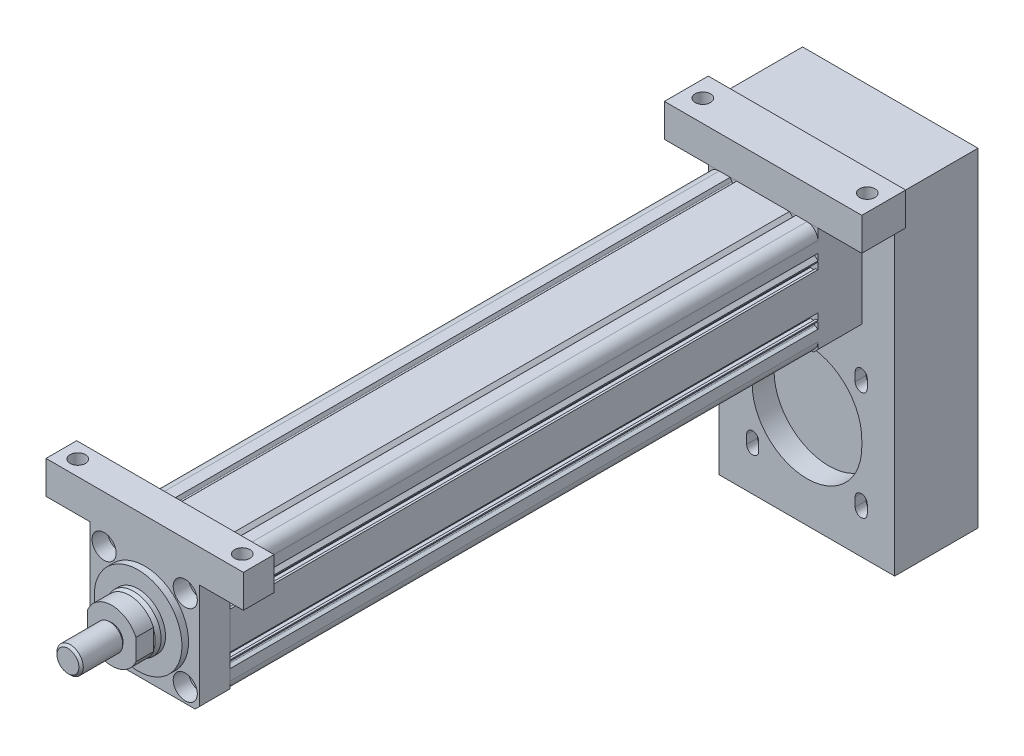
from build123d import *

# Parameters (mm, degrees)
SKETCH_1_R           = 20
SKETCH_1_R_2         = 2.75
EXTRUDE_1_DEPTH      = 268
FILLET_1_R           = 5
EXTRUDE_2_DEPTH      = 14
SKETCH_3_R           = 20
EXTRUDE_3_DEPTH      = 3
SKETCH_5_R           = 12.5
EXTRUDE_4_DEPTH      = 4
CHAMFER_1_SIZE       = 2
CHAMFER_1_SIZE2      = 0.7
EXTRUDE_5_DEPTH      = 8
SKETCH_7_R           = 5.15
EXTRUDE_6_DEPTH      = 1
SKETCH_8_R           = 6
EXTRUDE_7_DEPTH      = 19
CHAMFER_2_SIZE       = 1
SKETCH_23_W          = 50
SKETCH_23_H          = 50
EXTRUDE_8_DEPTH      = 20
SKETCH_4_R           = 3.5
CUT_EXTRUDE_5_DEPTH  = 30
SKETCH_4_6_R         = 5.5
CUT_EXTRUDE_6_DEPTH  = 7
SKETCH_35_W          = 80
SKETCH_35_H          = 150
EXTRUDE_10_DEPTH     = 38
CUT_EXTRUDE_11_DEPTH = 10
CUT_EXTRUDE_12_DEPTH = 10
CUT_EXTRUDE_START    = 10
CUT_EXTRUDE_13_DEPTH = 5
SKETCH_36_W          = 90
SKETCH_36_H          = 20
SKETCH_36_R          = 3.5
SKETCH_36_H_2        = 14
EXTRUDE_11_DEPTH     = 15
CHAMFER_4_SIZE       = 2
CHAMFER_5_SIZE       = 2


with BuildPart() as part:
    # Sketch 1 → Extrude 1 (new body)
    with BuildSketch(Plane.XY):
        with BuildLine():
            Line((-25, 25), (-15, 25))
            Line((-15, 25), (-14.227730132, 23.662389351))
            ThreePointArc((-14.227730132, 23.662389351), (-13.859980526, 23.416666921), (-13.441164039, 23.558835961))
            Line((-13.441164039, 23.558835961), (-12, 25))
            Line((-12, 25), (12, 25))
            Line((12, 25), (13.441164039, 23.558835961))
            ThreePointArc((13.441164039, 23.558835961), (13.859980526, 23.416666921), (14.227730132, 23.662389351))
            Line((14.227730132, 23.662389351), (15, 25))
            Line((15, 25), (25, 25))
            Line((25, 25), (25, 15))
            Line((25, 15), (23.662389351, 14.227730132))
            ThreePointArc((23.662389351, 14.227730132), (23.416666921, 13.859980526), (23.558835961, 13.441164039))
            Line((23.558835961, 13.441164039), (25, 12))
            Line((25, 12), (25, 11.5))
            Line((25, 11.5), (24, 11.5))
            Line((24, 11.5), (24, 12.4))
            Line((24, 12.4), (21.5, 12.4))
            Line((21.5, 12.4), (21.5, 7.6))
            Line((21.5, 7.6), (24, 7.6))
            Line((24, 7.6), (24, 8.5))
            Line((24, 8.5), (25, 8.5))
            Line((25, 8.5), (25, -8.5))
            Line((25, -8.5), (24, -8.5))
            Line((24, -8.5), (24, -7.6))
            Line((24, -7.6), (21.5, -7.6))
            Line((21.5, -7.6), (21.5, -12.4))
            Line((21.5, -12.4), (24, -12.4))
            Line((24, -12.4), (24, -11.5))
            Line((24, -11.5), (25, -11.5))
            Line((25, -11.5), (25, -12))
            Line((25, -12), (23.558835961, -13.441164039))
            ThreePointArc((23.558835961, -13.441164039), (23.416666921, -13.859980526), (23.662389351, -14.227730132))
            Line((23.662389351, -14.227730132), (25, -15))
            Line((25, -15), (25, -25))
            Line((25, -25), (15, -25))
            Line((15, -25), (14.227730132, -23.662389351))
            ThreePointArc((14.227730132, -23.662389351), (13.859980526, -23.416666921), (13.441164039, -23.558835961))
            Line((13.441164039, -23.558835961), (12, -25))
            Line((12, -25), (11.5, -25))
            Line((11.5, -25), (11.5, -24))
            Line((11.5, -24), (12.4, -24))
            Line((12.4, -24), (12.4, -21.5))
            Line((12.4, -21.5), (7.6, -21.5))
            Line((7.6, -21.5), (7.6, -24))
            Line((7.6, -24), (8.5, -24))
            Line((8.5, -24), (8.5, -25))
            Line((8.5, -25), (-8.5, -25))
            Line((-8.5, -25), (-8.5, -24))
            Line((-8.5, -24), (-7.6, -24))
            Line((-7.6, -24), (-7.6, -21.5))
            Line((-7.6, -21.5), (-12.4, -21.5))
            Line((-12.4, -21.5), (-12.4, -24))
            Line((-12.4, -24), (-11.5, -24))
            Line((-11.5, -24), (-11.5, -25))
            Line((-11.5, -25), (-12, -25))
            Line((-12, -25), (-13.441164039, -23.558835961))
            ThreePointArc((-13.441164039, -23.558835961), (-13.859980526, -23.416666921), (-14.227730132, -23.662389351))
            Line((-14.227730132, -23.662389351), (-15, -25))
            Line((-15, -25), (-25, -25))
            Line((-25, -25), (-25, -15))
            Line((-25, -15), (-23.662389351, -14.227730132))
            ThreePointArc((-23.662389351, -14.227730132), (-23.416666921, -13.859980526), (-23.558835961, -13.441164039))
            Line((-23.558835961, -13.441164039), (-25, -12))
            Line((-25, -12), (-25, -11.5))
            Line((-25, -11.5), (-24, -11.5))
            Line((-24, -11.5), (-24, -12.4))
            Line((-24, -12.4), (-21.5, -12.4))
            Line((-21.5, -12.4), (-21.5, -7.6))
            Line((-21.5, -7.6), (-24, -7.6))
            Line((-24, -7.6), (-24, -8.5))
            Line((-24, -8.5), (-25, -8.5))
            Line((-25, -8.5), (-25, 8.5))
            Line((-25, 8.5), (-24, 8.5))
            Line((-24, 8.5), (-24, 7.6))
            Line((-24, 7.6), (-21.5, 7.6))
            Line((-21.5, 7.6), (-21.5, 12.4))
            Line((-21.5, 12.4), (-24, 12.4))
            Line((-24, 12.4), (-24, 11.5))
            Line((-24, 11.5), (-25, 11.5))
            Line((-25, 11.5), (-25, 12))
            Line((-25, 12), (-23.558835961, 13.441164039))
            ThreePointArc((-23.558835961, 13.441164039), (-23.416666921, 13.859980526), (-23.662389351, 14.227730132))
            Line((-23.662389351, 14.227730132), (-25, 15))
            Line((-25, 15), (-25, 25))
        make_face()
        Circle(SKETCH_1_R, mode=Mode.SUBTRACT)
        with Locations((-18.5, 18.5)):
            Circle(SKETCH_1_R_2, mode=Mode.SUBTRACT)
        with Locations((18.5, 18.5)):
            Circle(SKETCH_1_R_2, mode=Mode.SUBTRACT)
        with Locations((18.5, -18.5)):
            Circle(SKETCH_1_R_2, mode=Mode.SUBTRACT)
        with Locations((-18.5, -18.5)):
            Circle(SKETCH_1_R_2, mode=Mode.SUBTRACT)
        with BuildLine():
            Line((-13.868836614, 23), (-5, 23))
            ThreePointArc((-5, 23), (-4.502985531, 22.554558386), (-4.891534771, 22.01190647))
            ThreePointArc((-4.891534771, 22.01190647), (-10.498377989, 19.955831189), (-15.368836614, 16.5))
            Line((-15.368836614, 16.5), (-15.368836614, 21.5))
            Line((-15.368836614, 21.5), (-13.868836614, 23))
        make_face(mode=Mode.SUBTRACT)
        with BuildLine():
            Line((15.368836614, 16.5), (15.368836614, 21.5))
            Line((15.368836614, 21.5), (13.868836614, 23))
            Line((13.868836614, 23), (5, 23))
            ThreePointArc((5, 23), (4.502985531, 22.554558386), (4.891534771, 22.01190647))
            ThreePointArc((4.891534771, 22.01190647), (10.498377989, 19.955831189), (15.368836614, 16.5))
        make_face(mode=Mode.SUBTRACT)
    extrude(amount=EXTRUDE_1_DEPTH)

    # Fillet 1
    fillet_1_edges = [part.edges().sort_by_distance(p)[0] for p in [
        (-25, 25, 134),
        (25, 25, 134),
        (25, -25, 134),
        (-25, -25, 134),
    ]]
    fillet(fillet_1_edges, radius=FILLET_1_R)

    # Sketch 23 → Extrude 8 (add)
    with BuildSketch(Plane(origin=(0, 0, 0), x_dir=(-1, 0, 0), z_dir=(0, 0, -1))):
        Rectangle(SKETCH_23_W, SKETCH_23_H)
    extrude(amount=EXTRUDE_8_DEPTH)

    # Sketch 27 → Hole Wizard M6 _1 (revolve, cut)
    with BuildSketch(Plane(origin=(0, -25, -12), x_dir=(0, 0, -1), z_dir=(1, 0, 0))):
        Polygon((0, 0), (0, 8.502151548), (2.5, 7), (2.5, 0), align=None)
    revolve(axis=Axis((0, -31.35, -12), (0, 1, 0)), mode=Mode.SUBTRACT)


with BuildPart() as body_2:
    # Sketch 2 → Extrude 2 (new body)
    with BuildSketch(Plane.XY.offset(268)):
        Polygon((-22, 25), (22, 25), (25, 25), (25, 22), (25, -22), (25, -25), (22, -25), (-22, -25), (-25, -25), (-25, -22), (-25, 22), (-25, 25), align=None)
    extrude(amount=EXTRUDE_2_DEPTH)


with BuildPart() as body_3:
    # Sketch 3 → Extrude 3 (new body)
    with BuildSketch(Plane.XY.offset(282)):
        Circle(SKETCH_3_R)
    extrude(amount=EXTRUDE_3_DEPTH)


with BuildPart() as body_4:
    # Sketch 5 → Extrude 4 (new body)
    with BuildSketch(Plane.XY.offset(285)):
        Circle(SKETCH_5_R)
    extrude(amount=EXTRUDE_4_DEPTH)

    # Chamfer 1
    chamfer_1_edges = [body_4.edges().sort_by_distance(p)[0] for p in [
        (-12.5, 0, 289),
    ]]
    chamfer_1_side = [body_4.faces().sort_by_distance(p)[0] for p in [
        (-12.5, 0, 287),
    ]]
    chamfer(chamfer_1_edges, length=CHAMFER_1_SIZE, length2=CHAMFER_1_SIZE2, reference=chamfer_1_side[0])


with BuildPart() as body_5:
    # Sketch 6 → Extrude 5 (new body)
    with BuildSketch(Plane.XY.offset(289)):
        with BuildLine():
            Line((-11, 4.795831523), (-11, -4.795831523))
            ThreePointArc((-11, -4.795831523), (0, -12), (11, -4.795831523))
            Line((11, -4.795831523), (11, 4.795831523))
            ThreePointArc((11, 4.795831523), (0, 12), (-11, 4.795831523))
        make_face()
    extrude(amount=EXTRUDE_5_DEPTH)


with BuildPart() as body_6:
    # Sketch 7 → Extrude 6 (new body)
    with BuildSketch(Plane.XY.offset(297)):
        Circle(SKETCH_7_R)
    extrude(amount=EXTRUDE_6_DEPTH)


with BuildPart() as body_7:
    # Sketch 8 → Extrude 7 (new body)
    with BuildSketch(Plane.XY.offset(298)):
        Circle(SKETCH_8_R)
    extrude(amount=EXTRUDE_7_DEPTH)

    # Chamfer 2
    chamfer_2_edges = [body_7.edges().sort_by_distance(p)[0] for p in [
        (-6, 0, 317),
    ]]
    chamfer(chamfer_2_edges, length=CHAMFER_2_SIZE)


with BuildPart() as cut_extrude_5_tool:
    # Sketch 4 → Cut-Extrude 5 (new body)
    with BuildSketch(Plane.XY.offset(282)):
        with Locations((-35, 17.5)):
            Circle(SKETCH_4_R)
        with Locations((-18.5, 18.5)):
            Circle(SKETCH_4_R)
        with Locations((-18.5, -18.5)):
            Circle(SKETCH_4_R)
        with Locations((-35, -17.5)):
            Circle(SKETCH_4_R)
        with Locations((35, -17.5)):
            Circle(SKETCH_4_R)
        with Locations((18.5, -18.5)):
            Circle(SKETCH_4_R)
        with Locations((18.5, 18.5)):
            Circle(SKETCH_4_R)
        with Locations((35, 17.5)):
            Circle(SKETCH_4_R)
    extrude(amount=-CUT_EXTRUDE_5_DEPTH)


with BuildPart() as part_1:
    add(part.part)

    # Cut-Extrude 5: cut by cut_extrude_5_tool
    add(cut_extrude_5_tool.part, mode=Mode.SUBTRACT)

    # Sketch 35 → Extrude 10 (add)
    with BuildSketch(Plane(origin=(0, 0, -20), x_dir=(-1, 0, 0), z_dir=(0, 0, -1))):
        with Locations((0, -40)):
            Rectangle(SKETCH_35_W, SKETCH_35_H)
    extrude(amount=EXTRUDE_10_DEPTH)

    # Sketch 35_3 → Cut-Extrude 11 (cut)
    with BuildSketch(Plane(origin=(0, 0, -20), x_dir=(-1, 0, 0), z_dir=(0, 0, -1))):
        with BuildLine():
            Line((25, -68.5), (25, -71.5))
            ThreePointArc((25, -71.5), (-0.002360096, -96.499999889), (-24.999999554, -71.495279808))
            Line((-24.999999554, -71.495279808), (-24.999464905, -68.663567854))
            ThreePointArc((-24.999464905, -68.663567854), (-0.081784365, -43.500133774), (25, -68.5))
        make_face()
    extrude(amount=CUT_EXTRUDE_11_DEPTH, mode=Mode.SUBTRACT)

    # Sketch 35_4 → Cut-Extrude 12 (cut)
    with BuildSketch(Plane(origin=(0, 0, -20), x_dir=(-1, 0, 0), z_dir=(0, 0, -1))):
        with BuildLine():
            Line((27.498737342, -92.748737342), (27.498737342, -96.748737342))
            ThreePointArc((27.498737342, -96.748737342), (24.748737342, -99.498737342), (21.998737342, -96.748737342))
            Line((21.998737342, -96.748737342), (21.998737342, -92.748737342))
            ThreePointArc((21.998737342, -92.748737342), (24.748737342, -89.998737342), (27.498737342, -92.748737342))
        make_face()
        with BuildLine():
            Line((-27.498737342, -92.748737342), (-27.498737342, -96.748737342))
            ThreePointArc((-27.498737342, -96.748737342), (-24.748737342, -99.498737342), (-21.998737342, -96.748737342))
            Line((-21.998737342, -96.748737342), (-21.998737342, -92.748737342))
            ThreePointArc((-21.998737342, -92.748737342), (-24.748737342, -89.998737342), (-27.498737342, -92.748737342))
        make_face()
        with BuildLine():
            Line((-27.498737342, -47.251262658), (-27.498737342, -43.251262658))
            ThreePointArc((-27.498737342, -43.251262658), (-24.748737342, -40.501262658), (-21.998737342, -43.251262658))
            Line((-21.998737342, -43.251262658), (-21.998737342, -47.251262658))
            ThreePointArc((-21.998737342, -47.251262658), (-24.748737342, -50.001262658), (-27.498737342, -47.251262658))
        make_face()
        with BuildLine():
            Line((27.498737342, -47.251262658), (27.498737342, -43.251262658))
            ThreePointArc((27.498737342, -43.251262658), (24.748737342, -40.501262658), (21.998737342, -43.251262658))
            Line((21.998737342, -43.251262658), (21.998737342, -47.251262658))
            ThreePointArc((21.998737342, -47.251262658), (24.748737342, -50.001262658), (27.498737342, -47.251262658))
        make_face()
    extrude(amount=CUT_EXTRUDE_12_DEPTH, mode=Mode.SUBTRACT)

    # Sketch 35_5 → Cut-Extrude 13 (cut)
    with BuildSketch(Plane(origin=(0, 0, -20), x_dir=(-1, 0, 0), z_dir=(0, 0, -1)).offset(CUT_EXTRUDE_START)):
        with BuildLine():
            Line((28.848737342, -91.848737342), (28.848737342, -97.648737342))
            ThreePointArc((28.848737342, -97.648737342), (24.748737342, -101.748737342), (20.648737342, -97.648737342))
            Line((20.648737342, -97.648737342), (20.648737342, -91.848737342))
            ThreePointArc((20.648737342, -91.848737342), (24.748737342, -87.748737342), (28.848737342, -91.848737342))
        make_face()
        with BuildLine():
            Line((-28.848737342, -91.848737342), (-28.848737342, -97.648737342))
            ThreePointArc((-28.848737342, -97.648737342), (-24.748737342, -101.748737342), (-20.648737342, -97.648737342))
            Line((-20.648737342, -97.648737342), (-20.648737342, -91.848737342))
            ThreePointArc((-20.648737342, -91.848737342), (-24.748737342, -87.748737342), (-28.848737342, -91.848737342))
        make_face()
        with BuildLine():
            Line((-28.848737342, -48.151262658), (-28.848737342, -42.351262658))
            ThreePointArc((-28.848737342, -42.351262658), (-24.748737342, -38.251262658), (-20.648737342, -42.351262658))
            Line((-20.648737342, -42.351262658), (-20.648737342, -48.151262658))
            ThreePointArc((-20.648737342, -48.151262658), (-24.748737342, -52.251262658), (-28.848737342, -48.151262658))
        make_face()
        with BuildLine():
            Line((28.848737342, -48.151262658), (28.848737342, -42.351262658))
            ThreePointArc((28.848737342, -42.351262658), (24.748737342, -38.251262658), (20.648737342, -42.351262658))
            Line((20.648737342, -42.351262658), (20.648737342, -48.151262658))
            ThreePointArc((20.648737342, -48.151262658), (24.748737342, -52.251262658), (28.848737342, -48.151262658))
        make_face()
    extrude(amount=-CUT_EXTRUDE_13_DEPTH, mode=Mode.SUBTRACT)

    # Chamfer 4
    chamfer_4_edges = [part_1.edges().sort_by_distance(p)[0] for p in [
        (25, -25, -10),
        (-25, -25, -10),
    ]]
    chamfer(chamfer_4_edges, length=CHAMFER_4_SIZE)


with BuildPart() as body_2_1:
    add(body_2.part)

    # Cut-Extrude 5: cut by cut_extrude_5_tool
    add(cut_extrude_5_tool.part, mode=Mode.SUBTRACT)

    # Sketch 4_6 → Cut-Extrude 6 (cut)
    with BuildSketch(Plane.XY.offset(282)):
        with Locations((-18.5, 18.5)):
            Circle(SKETCH_4_6_R)
        with Locations(Location((-18.5, -18.5, 0), (0, 0, 180))):
            Circle(SKETCH_4_6_R)
        with Locations((18.5, -18.5)):
            Circle(SKETCH_4_6_R)
        with Locations(Location((18.5, 18.5, 0), (0, 0, 180))):
            Circle(SKETCH_4_6_R)
    extrude(amount=-CUT_EXTRUDE_6_DEPTH, mode=Mode.SUBTRACT)

    # Sketch 36 → Extrude 11 (add)
    # profile 1 of 2: a face of its own
    with BuildSketch(Plane(origin=(0, 25, 0), x_dir=(1, 0, 0), z_dir=(0, 1, 0))):
        with Locations((0, 10)):
            Rectangle(SKETCH_36_W, SKETCH_36_H)
        with Locations(Location((37.5, 10, 0), (0, 0, 180))):
            Circle(SKETCH_36_R, mode=Mode.SUBTRACT)
        with Locations(Location((-37.5, 10, 0), (0, 0, 180))):
            Circle(SKETCH_36_R, mode=Mode.SUBTRACT)
    # profile 2 of 2: a face of its own
    with BuildSketch(Plane(origin=(0, 25, 0), x_dir=(1, 0, 0), z_dir=(0, 1, 0))):
        with Locations((0, -275)):
            Rectangle(SKETCH_36_W, SKETCH_36_H_2)
        with Locations(Location((37.5, -275, 0), (0, 0, 180))):
            Circle(SKETCH_36_R, mode=Mode.SUBTRACT)
        with Locations(Location((-37.5, -275, 0), (0, 0, 180))):
            Circle(SKETCH_36_R, mode=Mode.SUBTRACT)
    extrude(amount=EXTRUDE_11_DEPTH)


with BuildPart() as extrude_11_piece_1:
    # of the separate pieces the step leaves, piece 1, a body of its own (extrude_11_pieces)
    add(body_2_1.part.solids().sort_by_distance((45, 25, 268))[0])

    # Chamfer 5
    chamfer_5_edges = [extrude_11_piece_1.edges().sort_by_distance(p)[0] for p in [
        (25, -25, 275),
        (-25, -25, 275),
    ]]
    chamfer(chamfer_5_edges, length=CHAMFER_5_SIZE)


with BuildPart() as extrude_11_piece_2:
    # of the separate pieces the step leaves, piece 2, a body of its own (extrude_11_pieces)
    add(body_2_1.part.solids().sort_by_distance((45, 25, -20))[0])


solid = Compound([body_3.part, body_4.part, body_5.part, body_6.part, body_7.part, part_1.part, extrude_11_piece_1.part, extrude_11_piece_2.part])
